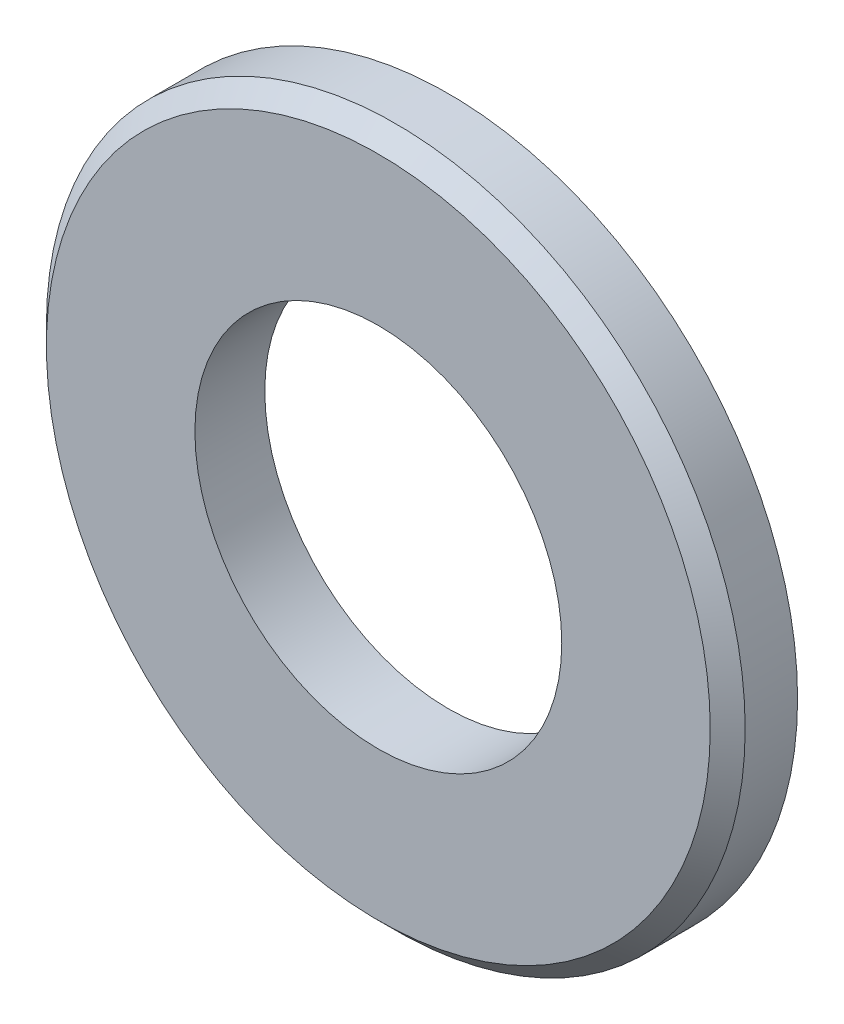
ISO-10303-21;
HEADER;
FILE_DESCRIPTION(('STEP AP214'),'2;1');
FILE_NAME('part.step','',(''),(''),'','','');
FILE_SCHEMA(('AUTOMOTIVE_DESIGN { 1 0 10303 214 1 1 1 1 }'));
ENDSEC;
DATA;
#1=APPLICATION_CONTEXT('core data for automotive mechanical design processes');
#2=APPLICATION_PROTOCOL_DEFINITION('international standard','automotive_design',2000,#1);
#3=PRODUCT_CONTEXT('',#1,'mechanical');
#4=PRODUCT('Part','Part','',(#3));
#5=PRODUCT_RELATED_PRODUCT_CATEGORY('part','',(#4));
#6=PRODUCT_DEFINITION_FORMATION('','',#4);
#7=PRODUCT_DEFINITION_CONTEXT('part definition',#1,'design');
#8=PRODUCT_DEFINITION('design','',#6,#7);
#9=PRODUCT_DEFINITION_SHAPE('','',#8);
#10=(LENGTH_UNIT() NAMED_UNIT(*) SI_UNIT(.MILLI.,.METRE.));
#11=(NAMED_UNIT(*) PLANE_ANGLE_UNIT() SI_UNIT($,.RADIAN.));
#12=(NAMED_UNIT(*) SI_UNIT($,.STERADIAN.) SOLID_ANGLE_UNIT());
#13=UNCERTAINTY_MEASURE_WITH_UNIT(LENGTH_MEASURE(1.E-05),#10,'distance_accuracy_value','');
#14=(GEOMETRIC_REPRESENTATION_CONTEXT(3) GLOBAL_UNCERTAINTY_ASSIGNED_CONTEXT((#13)) GLOBAL_UNIT_ASSIGNED_CONTEXT((#10,
#11,#12)) REPRESENTATION_CONTEXT('',''));
#15=CARTESIAN_POINT('',(0.,0.,0.));
#16=DIRECTION('',(0.,0.,1.));
#17=DIRECTION('',(1.,0.,0.));
#18=AXIS2_PLACEMENT_3D('',#15,#16,#17);
#19=CARTESIAN_POINT('',(0.,0.,-1.6));
#20=DIRECTION('',(0.,0.,1.));
#21=DIRECTION('',(1.,0.,0.));
#22=AXIS2_PLACEMENT_3D('',#19,#20,#21);
#23=CYLINDRICAL_SURFACE('',#22,8.);
#24=CARTESIAN_POINT('',(0.,0.,-0.399999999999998));
#25=DIRECTION('',(0.,0.,1.));
#26=DIRECTION('',(1.,0.,0.));
#27=AXIS2_PLACEMENT_3D('',#24,#25,#26);
#28=CIRCLE('',#27,8.);
#29=CARTESIAN_POINT('',(8.,0.,-0.399999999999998));
#30=VERTEX_POINT('',#29);
#31=EDGE_CURVE('E10',#30,#30,#28,.F.);
#32=ORIENTED_EDGE('',*,*,#31,.T.);
#33=EDGE_LOOP('',(#32));
#34=FACE_BOUND('',#33,.T.);
#35=CARTESIAN_POINT('',(0.,0.,-1.6));
#36=DIRECTION('',(0.,0.,1.));
#37=DIRECTION('',(1.,0.,0.));
#38=AXIS2_PLACEMENT_3D('',#35,#36,#37);
#39=CIRCLE('',#38,8.);
#40=CARTESIAN_POINT('',(8.,0.,-1.6));
#41=VERTEX_POINT('',#40);
#42=EDGE_CURVE('E56',#41,#41,#39,.T.);
#43=ORIENTED_EDGE('',*,*,#42,.T.);
#44=EDGE_LOOP('',(#43));
#45=FACE_BOUND('',#44,.T.);
#46=ADVANCED_FACE('F43',(#34,#45),#23,.T.);
#47=CARTESIAN_POINT('',(0.,0.,-1.6));
#48=DIRECTION('',(0.,0.,1.));
#49=DIRECTION('',(1.,0.,0.));
#50=AXIS2_PLACEMENT_3D('',#47,#48,#49);
#51=PLANE('',#50);
#52=CARTESIAN_POINT('',(0.,0.,-1.6));
#53=DIRECTION('',(0.,0.,1.));
#54=DIRECTION('',(1.,0.,0.));
#55=AXIS2_PLACEMENT_3D('',#52,#53,#54);
#56=CIRCLE('',#55,4.2);
#57=CARTESIAN_POINT('',(4.2,0.,-1.6));
#58=VERTEX_POINT('',#57);
#59=EDGE_CURVE('E61',#58,#58,#56,.T.);
#60=ORIENTED_EDGE('',*,*,#59,.T.);
#61=EDGE_LOOP('',(#60));
#62=FACE_BOUND('',#61,.T.);
#63=ORIENTED_EDGE('',*,*,#42,.F.);
#64=EDGE_LOOP('',(#63));
#65=FACE_BOUND('',#64,.T.);
#66=ADVANCED_FACE('F72',(#62,#65),#51,.F.);
#67=CARTESIAN_POINT('',(0.,0.,0.));
#68=DIRECTION('',(0.,0.,1.));
#69=DIRECTION('',(1.,0.,0.));
#70=AXIS2_PLACEMENT_3D('',#67,#68,#69);
#71=PLANE('',#70);
#72=CARTESIAN_POINT('',(0.,0.,0.));
#73=DIRECTION('',(0.,0.,1.));
#74=DIRECTION('',(1.,0.,0.));
#75=AXIS2_PLACEMENT_3D('',#72,#73,#74);
#76=CIRCLE('',#75,7.6);
#77=CARTESIAN_POINT('',(7.6,0.,0.));
#78=VERTEX_POINT('',#77);
#79=EDGE_CURVE('E51',#78,#78,#76,.T.);
#80=ORIENTED_EDGE('',*,*,#79,.T.);
#81=EDGE_LOOP('',(#80));
#82=FACE_BOUND('',#81,.T.);
#83=CARTESIAN_POINT('',(0.,0.,0.));
#84=DIRECTION('',(0.,0.,1.));
#85=DIRECTION('',(1.,0.,0.));
#86=AXIS2_PLACEMENT_3D('',#83,#84,#85);
#87=CIRCLE('',#86,4.2);
#88=CARTESIAN_POINT('',(4.2,0.,0.));
#89=VERTEX_POINT('',#88);
#90=EDGE_CURVE('E64',#89,#89,#87,.T.);
#91=ORIENTED_EDGE('',*,*,#90,.F.);
#92=EDGE_LOOP('',(#91));
#93=FACE_BOUND('',#92,.T.);
#94=ADVANCED_FACE('F78',(#82,#93),#71,.T.);
#95=CARTESIAN_POINT('',(0.,0.,-1.6));
#96=DIRECTION('',(0.,0.,1.));
#97=DIRECTION('',(1.,0.,0.));
#98=AXIS2_PLACEMENT_3D('',#95,#96,#97);
#99=CYLINDRICAL_SURFACE('',#98,4.2);
#100=ORIENTED_EDGE('',*,*,#59,.F.);
#101=EDGE_LOOP('',(#100));
#102=FACE_BOUND('',#101,.T.);
#103=ORIENTED_EDGE('',*,*,#90,.T.);
#104=EDGE_LOOP('',(#103));
#105=FACE_BOUND('',#104,.T.);
#106=ADVANCED_FACE('F75',(#102,#105),#99,.F.);
#107=CARTESIAN_POINT('',(0.,0.,0.));
#108=DIRECTION('',(0.,0.,-1.));
#109=DIRECTION('',(-1.,0.,0.));
#110=AXIS2_PLACEMENT_3D('',#107,#108,#109);
#111=CONICAL_SURFACE('',#110,7.6,0.785398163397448);
#112=ORIENTED_EDGE('',*,*,#31,.F.);
#113=EDGE_LOOP('',(#112));
#114=FACE_BOUND('',#113,.T.);
#115=ORIENTED_EDGE('',*,*,#79,.F.);
#116=EDGE_LOOP('',(#115));
#117=FACE_BOUND('',#116,.T.);
#118=ADVANCED_FACE('F45',(#114,#117),#111,.T.);
#119=CLOSED_SHELL('',(#46,#66,#94,#106,#118));
#120=MANIFOLD_SOLID_BREP('B2',#119);
#121=ADVANCED_BREP_SHAPE_REPRESENTATION('',(#18,#120),#14);
#122=SHAPE_DEFINITION_REPRESENTATION(#9,#121);
ENDSEC;
END-ISO-10303-21;
